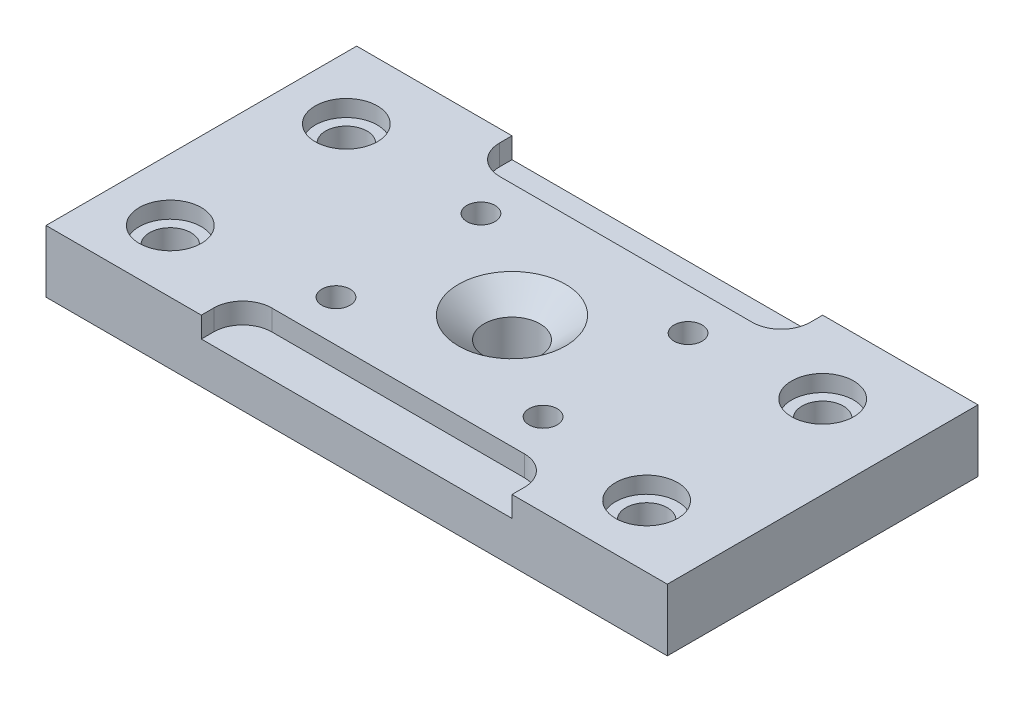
ISO-10303-21;
HEADER;
FILE_DESCRIPTION(('STEP AP214'),'2;1');
FILE_NAME('part.step','',(''),(''),'','','');
FILE_SCHEMA(('AUTOMOTIVE_DESIGN { 1 0 10303 214 1 1 1 1 }'));
ENDSEC;
DATA;
#1=APPLICATION_CONTEXT('core data for automotive mechanical design processes');
#2=APPLICATION_PROTOCOL_DEFINITION('international standard','automotive_design',2000,#1);
#3=PRODUCT_CONTEXT('',#1,'mechanical');
#4=PRODUCT('Part','Part','',(#3));
#5=PRODUCT_RELATED_PRODUCT_CATEGORY('part','',(#4));
#6=PRODUCT_DEFINITION_FORMATION('','',#4);
#7=PRODUCT_DEFINITION_CONTEXT('part definition',#1,'design');
#8=PRODUCT_DEFINITION('design','',#6,#7);
#9=PRODUCT_DEFINITION_SHAPE('','',#8);
#10=(LENGTH_UNIT() NAMED_UNIT(*) SI_UNIT(.MILLI.,.METRE.));
#11=(NAMED_UNIT(*) PLANE_ANGLE_UNIT() SI_UNIT($,.RADIAN.));
#12=(NAMED_UNIT(*) SI_UNIT($,.STERADIAN.) SOLID_ANGLE_UNIT());
#13=UNCERTAINTY_MEASURE_WITH_UNIT(LENGTH_MEASURE(1.E-05),#10,'distance_accuracy_value','');
#14=(GEOMETRIC_REPRESENTATION_CONTEXT(3) GLOBAL_UNCERTAINTY_ASSIGNED_CONTEXT((#13)) GLOBAL_UNIT_ASSIGNED_CONTEXT((#10,
#11,#12)) REPRESENTATION_CONTEXT('',''));
#15=CARTESIAN_POINT('',(0.,0.,0.));
#16=DIRECTION('',(0.,0.,1.));
#17=DIRECTION('',(1.,0.,0.));
#18=AXIS2_PLACEMENT_3D('',#15,#16,#17);
#19=CARTESIAN_POINT('',(-75.,15.,-37.5));
#20=DIRECTION('',(1.,0.,0.));
#21=DIRECTION('',(0.,0.,-1.));
#22=AXIS2_PLACEMENT_3D('',#19,#20,#21);
#23=PLANE('',#22);
#24=DIRECTION('',(0.,0.,1.));
#25=VECTOR('',#24,1.);
#26=CARTESIAN_POINT('',(-75.,0.,-37.5));
#27=LINE('',#26,#25);
#28=CARTESIAN_POINT('',(-75.,0.,-37.5));
#29=VERTEX_POINT('',#28);
#30=CARTESIAN_POINT('',(-75.,0.,37.5));
#31=VERTEX_POINT('',#30);
#32=EDGE_CURVE('E232',#29,#31,#27,.T.);
#33=ORIENTED_EDGE('',*,*,#32,.T.);
#34=DIRECTION('',(0.,-1.,0.));
#35=VECTOR('',#34,1.);
#36=CARTESIAN_POINT('',(-75.,15.,37.5));
#37=LINE('',#36,#35);
#38=CARTESIAN_POINT('',(-75.,15.,37.5));
#39=VERTEX_POINT('',#38);
#40=EDGE_CURVE('E271',#39,#31,#37,.T.);
#41=ORIENTED_EDGE('',*,*,#40,.F.);
#42=DIRECTION('',(0.,0.,1.));
#43=VECTOR('',#42,1.);
#44=CARTESIAN_POINT('',(-75.,15.,-37.5));
#45=LINE('',#44,#43);
#46=CARTESIAN_POINT('',(-75.,15.,-37.5));
#47=VERTEX_POINT('',#46);
#48=EDGE_CURVE('E250',#47,#39,#45,.T.);
#49=ORIENTED_EDGE('',*,*,#48,.F.);
#50=DIRECTION('',(0.,-1.,0.));
#51=VECTOR('',#50,1.);
#52=CARTESIAN_POINT('',(-75.,15.,-37.5));
#53=LINE('',#52,#51);
#54=EDGE_CURVE('E262',#47,#29,#53,.T.);
#55=ORIENTED_EDGE('',*,*,#54,.T.);
#56=EDGE_LOOP('',(#33,#41,#49,#55));
#57=FACE_BOUND('',#56,.T.);
#58=ADVANCED_FACE('F30',(#57),#23,.F.);
#59=CARTESIAN_POINT('',(-75.,15.,37.5));
#60=DIRECTION('',(0.,0.,-1.));
#61=DIRECTION('',(-1.,0.,0.));
#62=AXIS2_PLACEMENT_3D('',#59,#60,#61);
#63=PLANE('',#62);
#64=DIRECTION('',(1.,0.,0.));
#65=VECTOR('',#64,1.);
#66=CARTESIAN_POINT('',(37.5,10.,37.5));
#67=LINE('',#66,#65);
#68=CARTESIAN_POINT('',(-37.5,10.,37.5));
#69=VERTEX_POINT('',#68);
#70=CARTESIAN_POINT('',(37.5,10.,37.5));
#71=VERTEX_POINT('',#70);
#72=EDGE_CURVE('E211',#69,#71,#67,.T.);
#73=ORIENTED_EDGE('',*,*,#72,.F.);
#74=DIRECTION('',(0.,1.,0.));
#75=VECTOR('',#74,1.);
#76=CARTESIAN_POINT('',(-37.5,10.,37.5));
#77=LINE('',#76,#75);
#78=CARTESIAN_POINT('',(-37.5,15.,37.5));
#79=VERTEX_POINT('',#78);
#80=EDGE_CURVE('E229',#69,#79,#77,.T.);
#81=ORIENTED_EDGE('',*,*,#80,.T.);
#82=DIRECTION('',(1.,0.,0.));
#83=VECTOR('',#82,1.);
#84=CARTESIAN_POINT('',(-75.,15.,37.5));
#85=LINE('',#84,#83);
#86=EDGE_CURVE('E254',#39,#79,#85,.T.);
#87=ORIENTED_EDGE('',*,*,#86,.F.);
#88=ORIENTED_EDGE('',*,*,#40,.T.);
#89=DIRECTION('',(1.,0.,0.));
#90=VECTOR('',#89,1.);
#91=CARTESIAN_POINT('',(-75.,0.,37.5));
#92=LINE('',#91,#90);
#93=CARTESIAN_POINT('',(75.,0.,37.5));
#94=VERTEX_POINT('',#93);
#95=EDGE_CURVE('E244',#31,#94,#92,.T.);
#96=ORIENTED_EDGE('',*,*,#95,.T.);
#97=DIRECTION('',(0.,-1.,0.));
#98=VECTOR('',#97,1.);
#99=CARTESIAN_POINT('',(75.,15.,37.5));
#100=LINE('',#99,#98);
#101=CARTESIAN_POINT('',(75.,15.,37.5));
#102=VERTEX_POINT('',#101);
#103=EDGE_CURVE('E268',#102,#94,#100,.T.);
#104=ORIENTED_EDGE('',*,*,#103,.F.);
#105=CARTESIAN_POINT('',(37.5,15.,37.5));
#106=VERTEX_POINT('',#105);
#107=EDGE_CURVE('E253',#106,#102,#85,.T.);
#108=ORIENTED_EDGE('',*,*,#107,.F.);
#109=DIRECTION('',(0.,1.,0.));
#110=VECTOR('',#109,1.);
#111=CARTESIAN_POINT('',(37.5,10.,37.5));
#112=LINE('',#111,#110);
#113=EDGE_CURVE('E53',#71,#106,#112,.T.);
#114=ORIENTED_EDGE('',*,*,#113,.F.);
#115=EDGE_LOOP('',(#73,#81,#87,#88,#96,#104,#108,#114));
#116=FACE_BOUND('',#115,.T.);
#117=ADVANCED_FACE('F335',(#116),#63,.F.);
#118=CARTESIAN_POINT('',(75.,15.,-37.5));
#119=DIRECTION('',(-1.,0.,0.));
#120=DIRECTION('',(0.,0.,1.));
#121=AXIS2_PLACEMENT_3D('',#118,#119,#120);
#122=PLANE('',#121);
#123=DIRECTION('',(0.,0.,-1.));
#124=VECTOR('',#123,1.);
#125=CARTESIAN_POINT('',(75.,0.,-37.5));
#126=LINE('',#125,#124);
#127=CARTESIAN_POINT('',(75.,0.,-37.5));
#128=VERTEX_POINT('',#127);
#129=EDGE_CURVE('E246',#94,#128,#126,.T.);
#130=ORIENTED_EDGE('',*,*,#129,.T.);
#131=DIRECTION('',(0.,-1.,0.));
#132=VECTOR('',#131,1.);
#133=CARTESIAN_POINT('',(75.,15.,-37.5));
#134=LINE('',#133,#132);
#135=CARTESIAN_POINT('',(75.,15.,-37.5));
#136=VERTEX_POINT('',#135);
#137=EDGE_CURVE('E265',#136,#128,#134,.T.);
#138=ORIENTED_EDGE('',*,*,#137,.F.);
#139=DIRECTION('',(0.,0.,-1.));
#140=VECTOR('',#139,1.);
#141=CARTESIAN_POINT('',(75.,15.,-37.5));
#142=LINE('',#141,#140);
#143=EDGE_CURVE('E257',#102,#136,#142,.T.);
#144=ORIENTED_EDGE('',*,*,#143,.F.);
#145=ORIENTED_EDGE('',*,*,#103,.T.);
#146=EDGE_LOOP('',(#130,#138,#144,#145));
#147=FACE_BOUND('',#146,.T.);
#148=ADVANCED_FACE('F329',(#147),#122,.F.);
#149=CARTESIAN_POINT('',(-75.,15.,-37.5));
#150=DIRECTION('',(0.,0.,1.));
#151=DIRECTION('',(1.,0.,0.));
#152=AXIS2_PLACEMENT_3D('',#149,#150,#151);
#153=PLANE('',#152);
#154=DIRECTION('',(-1.,0.,0.));
#155=VECTOR('',#154,1.);
#156=CARTESIAN_POINT('',(-75.,15.,-37.5));
#157=LINE('',#156,#155);
#158=CARTESIAN_POINT('',(-37.5,15.,-37.5));
#159=VERTEX_POINT('',#158);
#160=EDGE_CURVE('E259',#159,#47,#157,.T.);
#161=ORIENTED_EDGE('',*,*,#160,.F.);
#162=DIRECTION('',(0.,1.,0.));
#163=VECTOR('',#162,1.);
#164=CARTESIAN_POINT('',(-37.5,10.,-37.5));
#165=LINE('',#164,#163);
#166=CARTESIAN_POINT('',(-37.5,10.,-37.5));
#167=VERTEX_POINT('',#166);
#168=EDGE_CURVE('E192',#167,#159,#165,.T.);
#169=ORIENTED_EDGE('',*,*,#168,.F.);
#170=DIRECTION('',(-1.,0.,0.));
#171=VECTOR('',#170,1.);
#172=CARTESIAN_POINT('',(37.5,10.,-37.5));
#173=LINE('',#172,#171);
#174=CARTESIAN_POINT('',(37.5,10.,-37.5));
#175=VERTEX_POINT('',#174);
#176=EDGE_CURVE('E184',#175,#167,#173,.T.);
#177=ORIENTED_EDGE('',*,*,#176,.F.);
#178=DIRECTION('',(0.,1.,0.));
#179=VECTOR('',#178,1.);
#180=CARTESIAN_POINT('',(37.5,10.,-37.5));
#181=LINE('',#180,#179);
#182=CARTESIAN_POINT('',(37.5,15.,-37.5));
#183=VERTEX_POINT('',#182);
#184=EDGE_CURVE('E194',#175,#183,#181,.T.);
#185=ORIENTED_EDGE('',*,*,#184,.T.);
#186=EDGE_CURVE('E260',#136,#183,#157,.T.);
#187=ORIENTED_EDGE('',*,*,#186,.F.);
#188=ORIENTED_EDGE('',*,*,#137,.T.);
#189=DIRECTION('',(-1.,0.,0.));
#190=VECTOR('',#189,1.);
#191=CARTESIAN_POINT('',(-75.,0.,-37.5));
#192=LINE('',#191,#190);
#193=EDGE_CURVE('E248',#128,#29,#192,.T.);
#194=ORIENTED_EDGE('',*,*,#193,.T.);
#195=ORIENTED_EDGE('',*,*,#54,.F.);
#196=EDGE_LOOP('',(#161,#169,#177,#185,#187,#188,#194,#195));
#197=FACE_BOUND('',#196,.T.);
#198=ADVANCED_FACE('F318',(#197),#153,.F.);
#199=CARTESIAN_POINT('',(-75.,15.,37.5));
#200=DIRECTION('',(0.,1.,0.));
#201=DIRECTION('',(0.,0.,1.));
#202=AXIS2_PLACEMENT_3D('',#199,#200,#201);
#203=PLANE('',#202);
#204=CARTESIAN_POINT('',(25.,15.,17.5));
#205=DIRECTION('',(0.,1.,0.));
#206=DIRECTION('',(0.,0.,1.));
#207=AXIS2_PLACEMENT_3D('',#204,#205,#206);
#208=CIRCLE('',#207,3.39999999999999);
#209=CARTESIAN_POINT('',(25.,15.,20.9));
#210=VERTEX_POINT('',#209);
#211=EDGE_CURVE('E512',#210,#210,#208,.T.);
#212=ORIENTED_EDGE('',*,*,#211,.F.);
#213=EDGE_LOOP('',(#212));
#214=FACE_BOUND('',#213,.T.);
#215=CARTESIAN_POINT('',(-25.,15.,17.5));
#216=DIRECTION('',(0.,1.,0.));
#217=DIRECTION('',(0.,0.,1.));
#218=AXIS2_PLACEMENT_3D('',#215,#216,#217);
#219=CIRCLE('',#218,3.39999999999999);
#220=CARTESIAN_POINT('',(-25.,15.,20.9));
#221=VERTEX_POINT('',#220);
#222=EDGE_CURVE('E506',#221,#221,#219,.T.);
#223=ORIENTED_EDGE('',*,*,#222,.F.);
#224=EDGE_LOOP('',(#223));
#225=FACE_BOUND('',#224,.T.);
#226=CARTESIAN_POINT('',(-25.,15.,-17.5));
#227=DIRECTION('',(0.,1.,0.));
#228=DIRECTION('',(0.,0.,1.));
#229=AXIS2_PLACEMENT_3D('',#226,#227,#228);
#230=CIRCLE('',#229,3.39999999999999);
#231=CARTESIAN_POINT('',(-25.,15.,-14.1));
#232=VERTEX_POINT('',#231);
#233=EDGE_CURVE('E500',#232,#232,#230,.T.);
#234=ORIENTED_EDGE('',*,*,#233,.F.);
#235=EDGE_LOOP('',(#234));
#236=FACE_BOUND('',#235,.T.);
#237=CARTESIAN_POINT('',(25.,15.,-17.5));
#238=DIRECTION('',(0.,1.,0.));
#239=DIRECTION('',(0.,0.,1.));
#240=AXIS2_PLACEMENT_3D('',#237,#238,#239);
#241=CIRCLE('',#240,3.39999999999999);
#242=CARTESIAN_POINT('',(25.,15.,-14.1));
#243=VERTEX_POINT('',#242);
#244=EDGE_CURVE('E494',#243,#243,#241,.T.);
#245=ORIENTED_EDGE('',*,*,#244,.F.);
#246=EDGE_LOOP('',(#245));
#247=FACE_BOUND('',#246,.T.);
#248=CARTESIAN_POINT('',(-60.,15.,-20.));
#249=DIRECTION('',(0.,1.,0.));
#250=DIRECTION('',(0.,0.,1.));
#251=AXIS2_PLACEMENT_3D('',#248,#249,#250);
#252=CIRCLE('',#251,7.5);
#253=CARTESIAN_POINT('',(-60.,15.,-12.5));
#254=VERTEX_POINT('',#253);
#255=EDGE_CURVE('E491',#254,#254,#252,.T.);
#256=ORIENTED_EDGE('',*,*,#255,.F.);
#257=EDGE_LOOP('',(#256));
#258=FACE_BOUND('',#257,.T.);
#259=CARTESIAN_POINT('',(-60.,15.,22.5));
#260=DIRECTION('',(0.,1.,0.));
#261=DIRECTION('',(0.,0.,1.));
#262=AXIS2_PLACEMENT_3D('',#259,#260,#261);
#263=CIRCLE('',#262,7.5);
#264=CARTESIAN_POINT('',(-60.,15.,30.));
#265=VERTEX_POINT('',#264);
#266=EDGE_CURVE('E283',#265,#265,#263,.T.);
#267=ORIENTED_EDGE('',*,*,#266,.F.);
#268=EDGE_LOOP('',(#267));
#269=FACE_BOUND('',#268,.T.);
#270=CARTESIAN_POINT('',(0.,15.,0.));
#271=DIRECTION('',(0.,1.,0.));
#272=DIRECTION('',(0.,0.,1.));
#273=AXIS2_PLACEMENT_3D('',#270,#271,#272);
#274=CIRCLE('',#273,12.9159);
#275=CARTESIAN_POINT('',(0.,15.,12.9159));
#276=VERTEX_POINT('',#275);
#277=EDGE_CURVE('E278',#276,#276,#274,.T.);
#278=ORIENTED_EDGE('',*,*,#277,.F.);
#279=EDGE_LOOP('',(#278));
#280=FACE_BOUND('',#279,.T.);
#281=DIRECTION('',(0.,0.,1.));
#282=VECTOR('',#281,1.);
#283=CARTESIAN_POINT('',(-37.5,15.,-37.5));
#284=LINE('',#283,#282);
#285=CARTESIAN_POINT('',(-37.5,15.,-34.5));
#286=VERTEX_POINT('',#285);
#287=EDGE_CURVE('E169',#159,#286,#284,.T.);
#288=ORIENTED_EDGE('',*,*,#287,.F.);
#289=ORIENTED_EDGE('',*,*,#160,.T.);
#290=ORIENTED_EDGE('',*,*,#48,.T.);
#291=ORIENTED_EDGE('',*,*,#86,.T.);
#292=DIRECTION('',(0.,0.,1.));
#293=VECTOR('',#292,1.);
#294=CARTESIAN_POINT('',(-37.5,15.,37.5));
#295=LINE('',#294,#293);
#296=CARTESIAN_POINT('',(-37.5,15.,34.5));
#297=VERTEX_POINT('',#296);
#298=EDGE_CURVE('E209',#297,#79,#295,.T.);
#299=ORIENTED_EDGE('',*,*,#298,.F.);
#300=CARTESIAN_POINT('',(-30.5,15.,34.5));
#301=DIRECTION('',(0.,1.,0.));
#302=DIRECTION('',(0.,0.,1.));
#303=AXIS2_PLACEMENT_3D('',#300,#301,#302);
#304=CIRCLE('',#303,7.);
#305=CARTESIAN_POINT('',(-30.5,15.,27.5));
#306=VERTEX_POINT('',#305);
#307=EDGE_CURVE('E206',#306,#297,#304,.T.);
#308=ORIENTED_EDGE('',*,*,#307,.F.);
#309=DIRECTION('',(-1.,0.,0.));
#310=VECTOR('',#309,1.);
#311=CARTESIAN_POINT('',(30.5,15.,27.5));
#312=LINE('',#311,#310);
#313=CARTESIAN_POINT('',(30.5,15.,27.5));
#314=VERTEX_POINT('',#313);
#315=EDGE_CURVE('E203',#314,#306,#312,.T.);
#316=ORIENTED_EDGE('',*,*,#315,.F.);
#317=CARTESIAN_POINT('',(30.5,15.,34.5));
#318=DIRECTION('',(0.,1.,0.));
#319=DIRECTION('',(0.,0.,-1.));
#320=AXIS2_PLACEMENT_3D('',#317,#318,#319);
#321=CIRCLE('',#320,7.);
#322=CARTESIAN_POINT('',(37.5,15.,34.5));
#323=VERTEX_POINT('',#322);
#324=EDGE_CURVE('E200',#323,#314,#321,.T.);
#325=ORIENTED_EDGE('',*,*,#324,.F.);
#326=DIRECTION('',(0.,0.,-1.));
#327=VECTOR('',#326,1.);
#328=CARTESIAN_POINT('',(37.5,15.,37.5));
#329=LINE('',#328,#327);
#330=EDGE_CURVE('E191',#106,#323,#329,.T.);
#331=ORIENTED_EDGE('',*,*,#330,.F.);
#332=ORIENTED_EDGE('',*,*,#107,.T.);
#333=ORIENTED_EDGE('',*,*,#143,.T.);
#334=ORIENTED_EDGE('',*,*,#186,.T.);
#335=DIRECTION('',(0.,0.,-1.));
#336=VECTOR('',#335,1.);
#337=CARTESIAN_POINT('',(37.5,15.,-37.5));
#338=LINE('',#337,#336);
#339=CARTESIAN_POINT('',(37.5,15.,-34.5));
#340=VERTEX_POINT('',#339);
#341=EDGE_CURVE('E167',#340,#183,#338,.T.);
#342=ORIENTED_EDGE('',*,*,#341,.F.);
#343=CARTESIAN_POINT('',(30.5,15.,-34.5));
#344=DIRECTION('',(0.,1.,0.));
#345=DIRECTION('',(0.,0.,1.));
#346=AXIS2_PLACEMENT_3D('',#343,#344,#345);
#347=CIRCLE('',#346,7.);
#348=CARTESIAN_POINT('',(30.5,15.,-27.5));
#349=VERTEX_POINT('',#348);
#350=EDGE_CURVE('E148',#349,#340,#347,.T.);
#351=ORIENTED_EDGE('',*,*,#350,.F.);
#352=DIRECTION('',(1.,0.,0.));
#353=VECTOR('',#352,1.);
#354=CARTESIAN_POINT('',(30.5,15.,-27.5));
#355=LINE('',#354,#353);
#356=CARTESIAN_POINT('',(-30.5,15.,-27.5));
#357=VERTEX_POINT('',#356);
#358=EDGE_CURVE('E159',#357,#349,#355,.T.);
#359=ORIENTED_EDGE('',*,*,#358,.F.);
#360=CARTESIAN_POINT('',(-30.5,15.,-34.5));
#361=DIRECTION('',(0.,1.,0.));
#362=DIRECTION('',(0.,0.,-1.));
#363=AXIS2_PLACEMENT_3D('',#360,#361,#362);
#364=CIRCLE('',#363,7.);
#365=EDGE_CURVE('E45',#286,#357,#364,.T.);
#366=ORIENTED_EDGE('',*,*,#365,.F.);
#367=EDGE_LOOP('',(#288,#289,#290,#291,#299,#308,#316,#325,#331,#332,#333,#334,#342,#351,#359,#366));
#368=FACE_BOUND('',#367,.T.);
#369=CARTESIAN_POINT('',(55.,15.,22.5));
#370=DIRECTION('',(0.,1.,0.));
#371=DIRECTION('',(0.,0.,1.));
#372=AXIS2_PLACEMENT_3D('',#369,#370,#371);
#373=CIRCLE('',#372,7.5);
#374=CARTESIAN_POINT('',(55.,15.,30.));
#375=VERTEX_POINT('',#374);
#376=EDGE_CURVE('E274',#375,#375,#373,.T.);
#377=ORIENTED_EDGE('',*,*,#376,.F.);
#378=EDGE_LOOP('',(#377));
#379=FACE_BOUND('',#378,.T.);
#380=CARTESIAN_POINT('',(55.,15.,-20.));
#381=DIRECTION('',(0.,1.,0.));
#382=DIRECTION('',(0.,0.,1.));
#383=AXIS2_PLACEMENT_3D('',#380,#381,#382);
#384=CIRCLE('',#383,7.5);
#385=CARTESIAN_POINT('',(55.,15.,-12.5));
#386=VERTEX_POINT('',#385);
#387=EDGE_CURVE('E295',#386,#386,#384,.T.);
#388=ORIENTED_EDGE('',*,*,#387,.F.);
#389=EDGE_LOOP('',(#388));
#390=FACE_BOUND('',#389,.T.);
#391=ADVANCED_FACE('F164',(#214,#225,#236,#247,#258,#269,#280,#368,#379,#390),#203,.T.);
#392=CARTESIAN_POINT('',(-75.,0.,37.5));
#393=DIRECTION('',(0.,1.,0.));
#394=DIRECTION('',(0.,0.,1.));
#395=AXIS2_PLACEMENT_3D('',#392,#393,#394);
#396=PLANE('',#395);
#397=CARTESIAN_POINT('',(25.,0.,17.5));
#398=DIRECTION('',(0.,1.,0.));
#399=DIRECTION('',(0.,0.,1.));
#400=AXIS2_PLACEMENT_3D('',#397,#398,#399);
#401=CIRCLE('',#400,3.4);
#402=CARTESIAN_POINT('',(25.,0.,20.9));
#403=VERTEX_POINT('',#402);
#404=EDGE_CURVE('E515',#403,#403,#401,.T.);
#405=ORIENTED_EDGE('',*,*,#404,.T.);
#406=EDGE_LOOP('',(#405));
#407=FACE_BOUND('',#406,.T.);
#408=CARTESIAN_POINT('',(-25.,0.,17.5));
#409=DIRECTION('',(0.,1.,0.));
#410=DIRECTION('',(0.,0.,1.));
#411=AXIS2_PLACEMENT_3D('',#408,#409,#410);
#412=CIRCLE('',#411,3.4);
#413=CARTESIAN_POINT('',(-25.,0.,20.9));
#414=VERTEX_POINT('',#413);
#415=EDGE_CURVE('E509',#414,#414,#412,.T.);
#416=ORIENTED_EDGE('',*,*,#415,.T.);
#417=EDGE_LOOP('',(#416));
#418=FACE_BOUND('',#417,.T.);
#419=CARTESIAN_POINT('',(-25.,0.,-17.5));
#420=DIRECTION('',(0.,1.,0.));
#421=DIRECTION('',(0.,0.,1.));
#422=AXIS2_PLACEMENT_3D('',#419,#420,#421);
#423=CIRCLE('',#422,3.4);
#424=CARTESIAN_POINT('',(-25.,0.,-14.1));
#425=VERTEX_POINT('',#424);
#426=EDGE_CURVE('E503',#425,#425,#423,.T.);
#427=ORIENTED_EDGE('',*,*,#426,.T.);
#428=EDGE_LOOP('',(#427));
#429=FACE_BOUND('',#428,.T.);
#430=CARTESIAN_POINT('',(25.,0.,-17.5));
#431=DIRECTION('',(0.,1.,0.));
#432=DIRECTION('',(0.,0.,1.));
#433=AXIS2_PLACEMENT_3D('',#430,#431,#432);
#434=CIRCLE('',#433,3.4);
#435=CARTESIAN_POINT('',(25.,0.,-14.1));
#436=VERTEX_POINT('',#435);
#437=EDGE_CURVE('E497',#436,#436,#434,.T.);
#438=ORIENTED_EDGE('',*,*,#437,.T.);
#439=EDGE_LOOP('',(#438));
#440=FACE_BOUND('',#439,.T.);
#441=CARTESIAN_POINT('',(-60.,0.,-20.));
#442=DIRECTION('',(0.,1.,0.));
#443=DIRECTION('',(0.,0.,1.));
#444=AXIS2_PLACEMENT_3D('',#441,#442,#443);
#445=CIRCLE('',#444,4.99999999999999);
#446=CARTESIAN_POINT('',(-60.,0.,-15.));
#447=VERTEX_POINT('',#446);
#448=EDGE_CURVE('E488',#447,#447,#445,.T.);
#449=ORIENTED_EDGE('',*,*,#448,.T.);
#450=EDGE_LOOP('',(#449));
#451=FACE_BOUND('',#450,.T.);
#452=CARTESIAN_POINT('',(-60.,0.,22.5));
#453=DIRECTION('',(0.,1.,0.));
#454=DIRECTION('',(0.,0.,1.));
#455=AXIS2_PLACEMENT_3D('',#452,#453,#454);
#456=CIRCLE('',#455,4.99999999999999);
#457=CARTESIAN_POINT('',(-60.,0.,27.5));
#458=VERTEX_POINT('',#457);
#459=EDGE_CURVE('E279',#458,#458,#456,.T.);
#460=ORIENTED_EDGE('',*,*,#459,.T.);
#461=EDGE_LOOP('',(#460));
#462=FACE_BOUND('',#461,.T.);
#463=CARTESIAN_POINT('',(0.,0.,0.));
#464=DIRECTION('',(0.,1.,0.));
#465=DIRECTION('',(0.,0.,1.));
#466=AXIS2_PLACEMENT_3D('',#463,#464,#465);
#467=CIRCLE('',#466,6.74624);
#468=CARTESIAN_POINT('',(0.,0.,6.74624));
#469=VERTEX_POINT('',#468);
#470=EDGE_CURVE('E275',#469,#469,#467,.T.);
#471=ORIENTED_EDGE('',*,*,#470,.T.);
#472=EDGE_LOOP('',(#471));
#473=FACE_BOUND('',#472,.T.);
#474=ORIENTED_EDGE('',*,*,#32,.F.);
#475=ORIENTED_EDGE('',*,*,#193,.F.);
#476=ORIENTED_EDGE('',*,*,#129,.F.);
#477=ORIENTED_EDGE('',*,*,#95,.F.);
#478=EDGE_LOOP('',(#474,#475,#476,#477));
#479=FACE_BOUND('',#478,.T.);
#480=CARTESIAN_POINT('',(55.,0.,22.5));
#481=DIRECTION('',(0.,1.,0.));
#482=DIRECTION('',(0.,0.,1.));
#483=AXIS2_PLACEMENT_3D('',#480,#481,#482);
#484=CIRCLE('',#483,4.99999999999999);
#485=CARTESIAN_POINT('',(55.,0.,27.5));
#486=VERTEX_POINT('',#485);
#487=EDGE_CURVE('E286',#486,#486,#484,.T.);
#488=ORIENTED_EDGE('',*,*,#487,.T.);
#489=EDGE_LOOP('',(#488));
#490=FACE_BOUND('',#489,.T.);
#491=CARTESIAN_POINT('',(55.,0.,-20.));
#492=DIRECTION('',(0.,1.,0.));
#493=DIRECTION('',(0.,0.,1.));
#494=AXIS2_PLACEMENT_3D('',#491,#492,#493);
#495=CIRCLE('',#494,4.99999999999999);
#496=CARTESIAN_POINT('',(55.,0.,-15.));
#497=VERTEX_POINT('',#496);
#498=EDGE_CURVE('E298',#497,#497,#495,.T.);
#499=ORIENTED_EDGE('',*,*,#498,.T.);
#500=EDGE_LOOP('',(#499));
#501=FACE_BOUND('',#500,.T.);
#502=ADVANCED_FACE('F317',(#407,#418,#429,#440,#451,#462,#473,#479,#490,#501),#396,.F.);
#503=CARTESIAN_POINT('',(-37.5,10.,37.5));
#504=DIRECTION('',(-1.,0.,0.));
#505=DIRECTION('',(0.,0.,1.));
#506=AXIS2_PLACEMENT_3D('',#503,#504,#505);
#507=PLANE('',#506);
#508=ORIENTED_EDGE('',*,*,#298,.T.);
#509=ORIENTED_EDGE('',*,*,#80,.F.);
#510=DIRECTION('',(0.,0.,1.));
#511=VECTOR('',#510,1.);
#512=CARTESIAN_POINT('',(-37.5,10.,37.5));
#513=LINE('',#512,#511);
#514=CARTESIAN_POINT('',(-37.5,10.,34.5));
#515=VERTEX_POINT('',#514);
#516=EDGE_CURVE('E226',#515,#69,#513,.T.);
#517=ORIENTED_EDGE('',*,*,#516,.F.);
#518=DIRECTION('',(0.,1.,0.));
#519=VECTOR('',#518,1.);
#520=CARTESIAN_POINT('',(-37.5,10.,34.5));
#521=LINE('',#520,#519);
#522=EDGE_CURVE('E233',#515,#297,#521,.T.);
#523=ORIENTED_EDGE('',*,*,#522,.T.);
#524=EDGE_LOOP('',(#508,#509,#517,#523));
#525=FACE_BOUND('',#524,.T.);
#526=ADVANCED_FACE('F325',(#525),#507,.F.);
#527=CARTESIAN_POINT('',(-30.5,10.,34.5));
#528=DIRECTION('',(0.,1.,0.));
#529=DIRECTION('',(0.,0.,1.));
#530=AXIS2_PLACEMENT_3D('',#527,#528,#529);
#531=CYLINDRICAL_SURFACE('',#530,7.);
#532=ORIENTED_EDGE('',*,*,#307,.T.);
#533=ORIENTED_EDGE('',*,*,#522,.F.);
#534=CARTESIAN_POINT('',(-30.5,10.,34.5));
#535=DIRECTION('',(0.,1.,0.));
#536=DIRECTION('',(0.,0.,1.));
#537=AXIS2_PLACEMENT_3D('',#534,#535,#536);
#538=CIRCLE('',#537,7.);
#539=CARTESIAN_POINT('',(-30.5,10.,27.5));
#540=VERTEX_POINT('',#539);
#541=EDGE_CURVE('E223',#540,#515,#538,.T.);
#542=ORIENTED_EDGE('',*,*,#541,.F.);
#543=DIRECTION('',(0.,1.,0.));
#544=VECTOR('',#543,1.);
#545=CARTESIAN_POINT('',(-30.5,10.,27.5));
#546=LINE('',#545,#544);
#547=EDGE_CURVE('E235',#540,#306,#546,.T.);
#548=ORIENTED_EDGE('',*,*,#547,.T.);
#549=EDGE_LOOP('',(#532,#533,#542,#548));
#550=FACE_BOUND('',#549,.T.);
#551=ADVANCED_FACE('F432',(#550),#531,.F.);
#552=CARTESIAN_POINT('',(30.5,10.,27.5));
#553=DIRECTION('',(0.,0.,-1.));
#554=DIRECTION('',(-1.,0.,0.));
#555=AXIS2_PLACEMENT_3D('',#552,#553,#554);
#556=PLANE('',#555);
#557=ORIENTED_EDGE('',*,*,#315,.T.);
#558=ORIENTED_EDGE('',*,*,#547,.F.);
#559=DIRECTION('',(-1.,0.,0.));
#560=VECTOR('',#559,1.);
#561=CARTESIAN_POINT('',(30.5,10.,27.5));
#562=LINE('',#561,#560);
#563=CARTESIAN_POINT('',(30.5,10.,27.5));
#564=VERTEX_POINT('',#563);
#565=EDGE_CURVE('E220',#564,#540,#562,.T.);
#566=ORIENTED_EDGE('',*,*,#565,.F.);
#567=DIRECTION('',(0.,1.,0.));
#568=VECTOR('',#567,1.);
#569=CARTESIAN_POINT('',(30.5,10.,27.5));
#570=LINE('',#569,#568);
#571=EDGE_CURVE('E237',#564,#314,#570,.T.);
#572=ORIENTED_EDGE('',*,*,#571,.T.);
#573=EDGE_LOOP('',(#557,#558,#566,#572));
#574=FACE_BOUND('',#573,.T.);
#575=ADVANCED_FACE('F436',(#574),#556,.F.);
#576=CARTESIAN_POINT('',(30.5,10.,34.5));
#577=DIRECTION('',(0.,1.,0.));
#578=DIRECTION('',(0.,0.,1.));
#579=AXIS2_PLACEMENT_3D('',#576,#577,#578);
#580=CYLINDRICAL_SURFACE('',#579,7.);
#581=ORIENTED_EDGE('',*,*,#324,.T.);
#582=ORIENTED_EDGE('',*,*,#571,.F.);
#583=CARTESIAN_POINT('',(30.5,10.,34.5));
#584=DIRECTION('',(0.,1.,0.));
#585=DIRECTION('',(0.,0.,-1.));
#586=AXIS2_PLACEMENT_3D('',#583,#584,#585);
#587=CIRCLE('',#586,7.);
#588=CARTESIAN_POINT('',(37.5,10.,34.5));
#589=VERTEX_POINT('',#588);
#590=EDGE_CURVE('E217',#589,#564,#587,.T.);
#591=ORIENTED_EDGE('',*,*,#590,.F.);
#592=DIRECTION('',(0.,1.,0.));
#593=VECTOR('',#592,1.);
#594=CARTESIAN_POINT('',(37.5,10.,34.5));
#595=LINE('',#594,#593);
#596=EDGE_CURVE('E239',#589,#323,#595,.T.);
#597=ORIENTED_EDGE('',*,*,#596,.T.);
#598=EDGE_LOOP('',(#581,#582,#591,#597));
#599=FACE_BOUND('',#598,.T.);
#600=ADVANCED_FACE('F440',(#599),#580,.F.);
#601=CARTESIAN_POINT('',(37.5,10.,37.5));
#602=DIRECTION('',(1.,0.,0.));
#603=DIRECTION('',(0.,0.,-1.));
#604=AXIS2_PLACEMENT_3D('',#601,#602,#603);
#605=PLANE('',#604);
#606=ORIENTED_EDGE('',*,*,#330,.T.);
#607=ORIENTED_EDGE('',*,*,#596,.F.);
#608=DIRECTION('',(0.,0.,-1.));
#609=VECTOR('',#608,1.);
#610=CARTESIAN_POINT('',(37.5,10.,37.5));
#611=LINE('',#610,#609);
#612=EDGE_CURVE('E214',#71,#589,#611,.T.);
#613=ORIENTED_EDGE('',*,*,#612,.F.);
#614=ORIENTED_EDGE('',*,*,#113,.T.);
#615=EDGE_LOOP('',(#606,#607,#613,#614));
#616=FACE_BOUND('',#615,.T.);
#617=ADVANCED_FACE('F428',(#616),#605,.F.);
#618=CARTESIAN_POINT('',(-30.5,10.,34.5));
#619=DIRECTION('',(0.,1.,0.));
#620=DIRECTION('',(0.,0.,1.));
#621=AXIS2_PLACEMENT_3D('',#618,#619,#620);
#622=PLANE('',#621);
#623=ORIENTED_EDGE('',*,*,#72,.T.);
#624=ORIENTED_EDGE('',*,*,#612,.T.);
#625=ORIENTED_EDGE('',*,*,#590,.T.);
#626=ORIENTED_EDGE('',*,*,#565,.T.);
#627=ORIENTED_EDGE('',*,*,#541,.T.);
#628=ORIENTED_EDGE('',*,*,#516,.T.);
#629=EDGE_LOOP('',(#623,#624,#625,#626,#627,#628));
#630=FACE_BOUND('',#629,.T.);
#631=ADVANCED_FACE('F425',(#630),#622,.T.);
#632=CARTESIAN_POINT('',(-30.5,10.,-34.5));
#633=DIRECTION('',(0.,1.,0.));
#634=DIRECTION('',(0.,0.,1.));
#635=AXIS2_PLACEMENT_3D('',#632,#633,#634);
#636=CYLINDRICAL_SURFACE('',#635,7.);
#637=ORIENTED_EDGE('',*,*,#365,.T.);
#638=DIRECTION('',(0.,1.,0.));
#639=VECTOR('',#638,1.);
#640=CARTESIAN_POINT('',(-30.5,10.,-27.5));
#641=LINE('',#640,#639);
#642=CARTESIAN_POINT('',(-30.5,10.,-27.5));
#643=VERTEX_POINT('',#642);
#644=EDGE_CURVE('E156',#643,#357,#641,.T.);
#645=ORIENTED_EDGE('',*,*,#644,.F.);
#646=CARTESIAN_POINT('',(-30.5,10.,-34.5));
#647=DIRECTION('',(0.,1.,0.));
#648=DIRECTION('',(0.,0.,-1.));
#649=AXIS2_PLACEMENT_3D('',#646,#647,#648);
#650=CIRCLE('',#649,7.);
#651=CARTESIAN_POINT('',(-37.5,10.,-34.5));
#652=VERTEX_POINT('',#651);
#653=EDGE_CURVE('E175',#652,#643,#650,.T.);
#654=ORIENTED_EDGE('',*,*,#653,.F.);
#655=DIRECTION('',(0.,1.,0.));
#656=VECTOR('',#655,1.);
#657=CARTESIAN_POINT('',(-37.5,10.,-34.5));
#658=LINE('',#657,#656);
#659=EDGE_CURVE('E189',#652,#286,#658,.T.);
#660=ORIENTED_EDGE('',*,*,#659,.T.);
#661=EDGE_LOOP('',(#637,#645,#654,#660));
#662=FACE_BOUND('',#661,.T.);
#663=ADVANCED_FACE('F414',(#662),#636,.F.);
#664=CARTESIAN_POINT('',(-37.5,10.,-37.5));
#665=DIRECTION('',(-1.,0.,0.));
#666=DIRECTION('',(0.,0.,1.));
#667=AXIS2_PLACEMENT_3D('',#664,#665,#666);
#668=PLANE('',#667);
#669=ORIENTED_EDGE('',*,*,#287,.T.);
#670=ORIENTED_EDGE('',*,*,#659,.F.);
#671=DIRECTION('',(0.,0.,1.));
#672=VECTOR('',#671,1.);
#673=CARTESIAN_POINT('',(-37.5,10.,-37.5));
#674=LINE('',#673,#672);
#675=EDGE_CURVE('E186',#167,#652,#674,.T.);
#676=ORIENTED_EDGE('',*,*,#675,.F.);
#677=ORIENTED_EDGE('',*,*,#168,.T.);
#678=EDGE_LOOP('',(#669,#670,#676,#677));
#679=FACE_BOUND('',#678,.T.);
#680=ADVANCED_FACE('F410',(#679),#668,.F.);
#681=CARTESIAN_POINT('',(37.5,10.,-37.5));
#682=DIRECTION('',(1.,0.,0.));
#683=DIRECTION('',(0.,0.,-1.));
#684=AXIS2_PLACEMENT_3D('',#681,#682,#683);
#685=PLANE('',#684);
#686=ORIENTED_EDGE('',*,*,#341,.T.);
#687=ORIENTED_EDGE('',*,*,#184,.F.);
#688=DIRECTION('',(0.,0.,-1.));
#689=VECTOR('',#688,1.);
#690=CARTESIAN_POINT('',(37.5,10.,-37.5));
#691=LINE('',#690,#689);
#692=CARTESIAN_POINT('',(37.5,10.,-34.5));
#693=VERTEX_POINT('',#692);
#694=EDGE_CURVE('E181',#693,#175,#691,.T.);
#695=ORIENTED_EDGE('',*,*,#694,.F.);
#696=DIRECTION('',(0.,1.,0.));
#697=VECTOR('',#696,1.);
#698=CARTESIAN_POINT('',(37.5,10.,-34.5));
#699=LINE('',#698,#697);
#700=EDGE_CURVE('E155',#693,#340,#699,.T.);
#701=ORIENTED_EDGE('',*,*,#700,.T.);
#702=EDGE_LOOP('',(#686,#687,#695,#701));
#703=FACE_BOUND('',#702,.T.);
#704=ADVANCED_FACE('F413',(#703),#685,.F.);
#705=CARTESIAN_POINT('',(30.5,10.,-34.5));
#706=DIRECTION('',(0.,1.,0.));
#707=DIRECTION('',(0.,0.,1.));
#708=AXIS2_PLACEMENT_3D('',#705,#706,#707);
#709=CYLINDRICAL_SURFACE('',#708,7.);
#710=ORIENTED_EDGE('',*,*,#350,.T.);
#711=ORIENTED_EDGE('',*,*,#700,.F.);
#712=CARTESIAN_POINT('',(30.5,10.,-34.5));
#713=DIRECTION('',(0.,1.,0.));
#714=DIRECTION('',(0.,0.,1.));
#715=AXIS2_PLACEMENT_3D('',#712,#713,#714);
#716=CIRCLE('',#715,7.);
#717=CARTESIAN_POINT('',(30.5,10.,-27.5));
#718=VERTEX_POINT('',#717);
#719=EDGE_CURVE('E151',#718,#693,#716,.T.);
#720=ORIENTED_EDGE('',*,*,#719,.F.);
#721=DIRECTION('',(0.,1.,0.));
#722=VECTOR('',#721,1.);
#723=CARTESIAN_POINT('',(30.5,10.,-27.5));
#724=LINE('',#723,#722);
#725=EDGE_CURVE('E144',#718,#349,#724,.T.);
#726=ORIENTED_EDGE('',*,*,#725,.T.);
#727=EDGE_LOOP('',(#710,#711,#720,#726));
#728=FACE_BOUND('',#727,.T.);
#729=ADVANCED_FACE('F146',(#728),#709,.F.);
#730=CARTESIAN_POINT('',(30.5,10.,-27.5));
#731=DIRECTION('',(0.,0.,1.));
#732=DIRECTION('',(1.,0.,0.));
#733=AXIS2_PLACEMENT_3D('',#730,#731,#732);
#734=PLANE('',#733);
#735=ORIENTED_EDGE('',*,*,#358,.T.);
#736=ORIENTED_EDGE('',*,*,#725,.F.);
#737=DIRECTION('',(1.,0.,0.));
#738=VECTOR('',#737,1.);
#739=CARTESIAN_POINT('',(30.5,10.,-27.5));
#740=LINE('',#739,#738);
#741=EDGE_CURVE('E178',#643,#718,#740,.T.);
#742=ORIENTED_EDGE('',*,*,#741,.F.);
#743=ORIENTED_EDGE('',*,*,#644,.T.);
#744=EDGE_LOOP('',(#735,#736,#742,#743));
#745=FACE_BOUND('',#744,.T.);
#746=ADVANCED_FACE('F160',(#745),#734,.F.);
#747=CARTESIAN_POINT('',(-30.5,10.,-34.5));
#748=DIRECTION('',(0.,-1.,0.));
#749=DIRECTION('',(0.,0.,-1.));
#750=AXIS2_PLACEMENT_3D('',#747,#748,#749);
#751=PLANE('',#750);
#752=ORIENTED_EDGE('',*,*,#653,.T.);
#753=ORIENTED_EDGE('',*,*,#741,.T.);
#754=ORIENTED_EDGE('',*,*,#719,.T.);
#755=ORIENTED_EDGE('',*,*,#694,.T.);
#756=ORIENTED_EDGE('',*,*,#176,.T.);
#757=ORIENTED_EDGE('',*,*,#675,.T.);
#758=EDGE_LOOP('',(#752,#753,#754,#755,#756,#757));
#759=FACE_BOUND('',#758,.T.);
#760=ADVANCED_FACE('F402',(#759),#751,.F.);
#761=CARTESIAN_POINT('',(0.,15.,0.));
#762=DIRECTION('',(0.,1.,0.));
#763=DIRECTION('',(0.,0.,1.));
#764=AXIS2_PLACEMENT_3D('',#761,#762,#763);
#765=CYLINDRICAL_SURFACE('',#764,6.74624);
#766=CARTESIAN_POINT('',(0.,9.82304056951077,0.));
#767=DIRECTION('',(0.,1.,0.));
#768=DIRECTION('',(0.,0.,1.));
#769=AXIS2_PLACEMENT_3D('',#766,#767,#768);
#770=CIRCLE('',#769,6.74624);
#771=CARTESIAN_POINT('',(0.,9.82304056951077,6.74624));
#772=VERTEX_POINT('',#771);
#773=EDGE_CURVE('E282',#772,#772,#770,.T.);
#774=ORIENTED_EDGE('',*,*,#773,.T.);
#775=EDGE_LOOP('',(#774));
#776=FACE_BOUND('',#775,.T.);
#777=ORIENTED_EDGE('',*,*,#470,.F.);
#778=EDGE_LOOP('',(#777));
#779=FACE_BOUND('',#778,.T.);
#780=ADVANCED_FACE('F399',(#776,#779),#765,.F.);
#781=CARTESIAN_POINT('',(0.,15.,0.));
#782=DIRECTION('',(0.,1.,0.));
#783=DIRECTION('',(0.,0.,1.));
#784=AXIS2_PLACEMENT_3D('',#781,#782,#783);
#785=CONICAL_SURFACE('',#784,12.9159,0.872664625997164);
#786=ORIENTED_EDGE('',*,*,#773,.F.);
#787=EDGE_LOOP('',(#786));
#788=FACE_BOUND('',#787,.T.);
#789=ORIENTED_EDGE('',*,*,#277,.T.);
#790=EDGE_LOOP('',(#789));
#791=FACE_BOUND('',#790,.T.);
#792=ADVANCED_FACE('F391',(#788,#791),#785,.F.);
#793=CARTESIAN_POINT('',(-60.,15.,22.5));
#794=DIRECTION('',(0.,1.,0.));
#795=DIRECTION('',(0.,0.,1.));
#796=AXIS2_PLACEMENT_3D('',#793,#794,#795);
#797=CYLINDRICAL_SURFACE('',#796,4.99999999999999);
#798=CARTESIAN_POINT('',(-60.,11.,22.5));
#799=DIRECTION('',(0.,1.,0.));
#800=DIRECTION('',(0.,0.,1.));
#801=AXIS2_PLACEMENT_3D('',#798,#799,#800);
#802=CIRCLE('',#801,5.);
#803=CARTESIAN_POINT('',(-60.,11.,27.5));
#804=VERTEX_POINT('',#803);
#805=EDGE_CURVE('E479',#804,#804,#802,.T.);
#806=ORIENTED_EDGE('',*,*,#805,.T.);
#807=EDGE_LOOP('',(#806));
#808=FACE_BOUND('',#807,.T.);
#809=ORIENTED_EDGE('',*,*,#459,.F.);
#810=EDGE_LOOP('',(#809));
#811=FACE_BOUND('',#810,.T.);
#812=ADVANCED_FACE('F387',(#808,#811),#797,.F.);
#813=CARTESIAN_POINT('',(-60.,15.,22.5));
#814=DIRECTION('',(0.,1.,0.));
#815=DIRECTION('',(0.,0.,1.));
#816=AXIS2_PLACEMENT_3D('',#813,#814,#815);
#817=CYLINDRICAL_SURFACE('',#816,7.5);
#818=CARTESIAN_POINT('',(-60.,11.,22.5));
#819=DIRECTION('',(0.,1.,0.));
#820=DIRECTION('',(0.,0.,1.));
#821=AXIS2_PLACEMENT_3D('',#818,#819,#820);
#822=CIRCLE('',#821,7.5);
#823=CARTESIAN_POINT('',(-60.,11.,30.));
#824=VERTEX_POINT('',#823);
#825=EDGE_CURVE('E476',#824,#824,#822,.T.);
#826=ORIENTED_EDGE('',*,*,#825,.F.);
#827=EDGE_LOOP('',(#826));
#828=FACE_BOUND('',#827,.T.);
#829=ORIENTED_EDGE('',*,*,#266,.T.);
#830=EDGE_LOOP('',(#829));
#831=FACE_BOUND('',#830,.T.);
#832=ADVANCED_FACE('F390',(#828,#831),#817,.F.);
#833=CARTESIAN_POINT('',(-55.,11.,22.5));
#834=DIRECTION('',(0.,-1.,0.));
#835=DIRECTION('',(0.,0.,-1.));
#836=AXIS2_PLACEMENT_3D('',#833,#834,#835);
#837=PLANE('',#836);
#838=ORIENTED_EDGE('',*,*,#805,.F.);
#839=EDGE_LOOP('',(#838));
#840=FACE_BOUND('',#839,.T.);
#841=ORIENTED_EDGE('',*,*,#825,.T.);
#842=EDGE_LOOP('',(#841));
#843=FACE_BOUND('',#842,.T.);
#844=ADVANCED_FACE('F380',(#840,#843),#837,.F.);
#845=CARTESIAN_POINT('',(-60.,15.,-20.));
#846=DIRECTION('',(0.,1.,0.));
#847=DIRECTION('',(0.,0.,1.));
#848=AXIS2_PLACEMENT_3D('',#845,#846,#847);
#849=CYLINDRICAL_SURFACE('',#848,4.99999999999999);
#850=CARTESIAN_POINT('',(-60.,11.,-20.));
#851=DIRECTION('',(0.,1.,0.));
#852=DIRECTION('',(0.,0.,1.));
#853=AXIS2_PLACEMENT_3D('',#850,#851,#852);
#854=CIRCLE('',#853,5.);
#855=CARTESIAN_POINT('',(-60.,11.,-15.));
#856=VERTEX_POINT('',#855);
#857=EDGE_CURVE('E485',#856,#856,#854,.T.);
#858=ORIENTED_EDGE('',*,*,#857,.T.);
#859=EDGE_LOOP('',(#858));
#860=FACE_BOUND('',#859,.T.);
#861=ORIENTED_EDGE('',*,*,#448,.F.);
#862=EDGE_LOOP('',(#861));
#863=FACE_BOUND('',#862,.T.);
#864=ADVANCED_FACE('F358',(#860,#863),#849,.F.);
#865=CARTESIAN_POINT('',(-60.,15.,-20.));
#866=DIRECTION('',(0.,1.,0.));
#867=DIRECTION('',(0.,0.,1.));
#868=AXIS2_PLACEMENT_3D('',#865,#866,#867);
#869=CYLINDRICAL_SURFACE('',#868,7.5);
#870=CARTESIAN_POINT('',(-60.,11.,-20.));
#871=DIRECTION('',(0.,1.,0.));
#872=DIRECTION('',(0.,0.,1.));
#873=AXIS2_PLACEMENT_3D('',#870,#871,#872);
#874=CIRCLE('',#873,7.5);
#875=CARTESIAN_POINT('',(-60.,11.,-12.5));
#876=VERTEX_POINT('',#875);
#877=EDGE_CURVE('E482',#876,#876,#874,.T.);
#878=ORIENTED_EDGE('',*,*,#877,.F.);
#879=EDGE_LOOP('',(#878));
#880=FACE_BOUND('',#879,.T.);
#881=ORIENTED_EDGE('',*,*,#255,.T.);
#882=EDGE_LOOP('',(#881));
#883=FACE_BOUND('',#882,.T.);
#884=ADVANCED_FACE('F378',(#880,#883),#869,.F.);
#885=CARTESIAN_POINT('',(-55.,11.,-20.));
#886=DIRECTION('',(0.,-1.,0.));
#887=DIRECTION('',(0.,0.,-1.));
#888=AXIS2_PLACEMENT_3D('',#885,#886,#887);
#889=PLANE('',#888);
#890=ORIENTED_EDGE('',*,*,#857,.F.);
#891=EDGE_LOOP('',(#890));
#892=FACE_BOUND('',#891,.T.);
#893=ORIENTED_EDGE('',*,*,#877,.T.);
#894=EDGE_LOOP('',(#893));
#895=FACE_BOUND('',#894,.T.);
#896=ADVANCED_FACE('F356',(#892,#895),#889,.F.);
#897=CARTESIAN_POINT('',(60.,11.,22.5));
#898=DIRECTION('',(0.,-1.,0.));
#899=DIRECTION('',(0.,0.,-1.));
#900=AXIS2_PLACEMENT_3D('',#897,#898,#899);
#901=PLANE('',#900);
#902=CARTESIAN_POINT('',(55.,11.,22.5));
#903=DIRECTION('',(0.,1.,0.));
#904=DIRECTION('',(0.,0.,1.));
#905=AXIS2_PLACEMENT_3D('',#902,#903,#904);
#906=CIRCLE('',#905,5.);
#907=CARTESIAN_POINT('',(55.,11.,27.5));
#908=VERTEX_POINT('',#907);
#909=EDGE_CURVE('E289',#908,#908,#906,.T.);
#910=ORIENTED_EDGE('',*,*,#909,.F.);
#911=EDGE_LOOP('',(#910));
#912=FACE_BOUND('',#911,.T.);
#913=CARTESIAN_POINT('',(55.,11.,22.5));
#914=DIRECTION('',(0.,1.,0.));
#915=DIRECTION('',(0.,0.,1.));
#916=AXIS2_PLACEMENT_3D('',#913,#914,#915);
#917=CIRCLE('',#916,7.5);
#918=CARTESIAN_POINT('',(55.,11.,30.));
#919=VERTEX_POINT('',#918);
#920=EDGE_CURVE('E292',#919,#919,#917,.T.);
#921=ORIENTED_EDGE('',*,*,#920,.T.);
#922=EDGE_LOOP('',(#921));
#923=FACE_BOUND('',#922,.T.);
#924=ADVANCED_FACE('F352',(#912,#923),#901,.F.);
#925=CARTESIAN_POINT('',(55.,15.,22.5));
#926=DIRECTION('',(0.,1.,0.));
#927=DIRECTION('',(0.,0.,1.));
#928=AXIS2_PLACEMENT_3D('',#925,#926,#927);
#929=CYLINDRICAL_SURFACE('',#928,7.5);
#930=ORIENTED_EDGE('',*,*,#920,.F.);
#931=EDGE_LOOP('',(#930));
#932=FACE_BOUND('',#931,.T.);
#933=ORIENTED_EDGE('',*,*,#376,.T.);
#934=EDGE_LOOP('',(#933));
#935=FACE_BOUND('',#934,.T.);
#936=ADVANCED_FACE('F348',(#932,#935),#929,.F.);
#937=CARTESIAN_POINT('',(55.,15.,22.5));
#938=DIRECTION('',(0.,1.,0.));
#939=DIRECTION('',(0.,0.,1.));
#940=AXIS2_PLACEMENT_3D('',#937,#938,#939);
#941=CYLINDRICAL_SURFACE('',#940,4.99999999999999);
#942=ORIENTED_EDGE('',*,*,#909,.T.);
#943=EDGE_LOOP('',(#942));
#944=FACE_BOUND('',#943,.T.);
#945=ORIENTED_EDGE('',*,*,#487,.F.);
#946=EDGE_LOOP('',(#945));
#947=FACE_BOUND('',#946,.T.);
#948=ADVANCED_FACE('F309',(#944,#947),#941,.F.);
#949=CARTESIAN_POINT('',(60.,11.,-20.));
#950=DIRECTION('',(0.,-1.,0.));
#951=DIRECTION('',(0.,0.,-1.));
#952=AXIS2_PLACEMENT_3D('',#949,#950,#951);
#953=PLANE('',#952);
#954=CARTESIAN_POINT('',(55.,11.,-20.));
#955=DIRECTION('',(0.,1.,0.));
#956=DIRECTION('',(0.,0.,1.));
#957=AXIS2_PLACEMENT_3D('',#954,#955,#956);
#958=CIRCLE('',#957,5.);
#959=CARTESIAN_POINT('',(55.,11.,-15.));
#960=VERTEX_POINT('',#959);
#961=EDGE_CURVE('E38',#960,#960,#958,.T.);
#962=ORIENTED_EDGE('',*,*,#961,.F.);
#963=EDGE_LOOP('',(#962));
#964=FACE_BOUND('',#963,.T.);
#965=CARTESIAN_POINT('',(55.,11.,-20.));
#966=DIRECTION('',(0.,1.,0.));
#967=DIRECTION('',(0.,0.,1.));
#968=AXIS2_PLACEMENT_3D('',#965,#966,#967);
#969=CIRCLE('',#968,7.5);
#970=CARTESIAN_POINT('',(55.,11.,-12.5));
#971=VERTEX_POINT('',#970);
#972=EDGE_CURVE('E11',#971,#971,#969,.T.);
#973=ORIENTED_EDGE('',*,*,#972,.T.);
#974=EDGE_LOOP('',(#973));
#975=FACE_BOUND('',#974,.T.);
#976=ADVANCED_FACE('F32',(#964,#975),#953,.F.);
#977=CARTESIAN_POINT('',(55.,15.,-20.));
#978=DIRECTION('',(0.,1.,0.));
#979=DIRECTION('',(0.,0.,1.));
#980=AXIS2_PLACEMENT_3D('',#977,#978,#979);
#981=CYLINDRICAL_SURFACE('',#980,7.5);
#982=ORIENTED_EDGE('',*,*,#972,.F.);
#983=EDGE_LOOP('',(#982));
#984=FACE_BOUND('',#983,.T.);
#985=ORIENTED_EDGE('',*,*,#387,.T.);
#986=EDGE_LOOP('',(#985));
#987=FACE_BOUND('',#986,.T.);
#988=ADVANCED_FACE('F308',(#984,#987),#981,.F.);
#989=CARTESIAN_POINT('',(55.,15.,-20.));
#990=DIRECTION('',(0.,1.,0.));
#991=DIRECTION('',(0.,0.,1.));
#992=AXIS2_PLACEMENT_3D('',#989,#990,#991);
#993=CYLINDRICAL_SURFACE('',#992,4.99999999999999);
#994=ORIENTED_EDGE('',*,*,#961,.T.);
#995=EDGE_LOOP('',(#994));
#996=FACE_BOUND('',#995,.T.);
#997=ORIENTED_EDGE('',*,*,#498,.F.);
#998=EDGE_LOOP('',(#997));
#999=FACE_BOUND('',#998,.T.);
#1000=ADVANCED_FACE('F303',(#996,#999),#993,.F.);
#1001=CARTESIAN_POINT('',(25.,15.,-17.5));
#1002=DIRECTION('',(0.,1.,0.));
#1003=DIRECTION('',(0.,0.,1.));
#1004=AXIS2_PLACEMENT_3D('',#1001,#1002,#1003);
#1005=CYLINDRICAL_SURFACE('',#1004,3.39999999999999);
#1006=ORIENTED_EDGE('',*,*,#437,.F.);
#1007=EDGE_LOOP('',(#1006));
#1008=FACE_BOUND('',#1007,.T.);
#1009=ORIENTED_EDGE('',*,*,#244,.T.);
#1010=EDGE_LOOP('',(#1009));
#1011=FACE_BOUND('',#1010,.T.);
#1012=ADVANCED_FACE('F359',(#1008,#1011),#1005,.F.);
#1013=CARTESIAN_POINT('',(-25.,15.,-17.5));
#1014=DIRECTION('',(0.,1.,0.));
#1015=DIRECTION('',(0.,0.,1.));
#1016=AXIS2_PLACEMENT_3D('',#1013,#1014,#1015);
#1017=CYLINDRICAL_SURFACE('',#1016,3.39999999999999);
#1018=ORIENTED_EDGE('',*,*,#426,.F.);
#1019=EDGE_LOOP('',(#1018));
#1020=FACE_BOUND('',#1019,.T.);
#1021=ORIENTED_EDGE('',*,*,#233,.T.);
#1022=EDGE_LOOP('',(#1021));
#1023=FACE_BOUND('',#1022,.T.);
#1024=ADVANCED_FACE('F363',(#1020,#1023),#1017,.F.);
#1025=CARTESIAN_POINT('',(-25.,15.,17.5));
#1026=DIRECTION('',(0.,1.,0.));
#1027=DIRECTION('',(0.,0.,1.));
#1028=AXIS2_PLACEMENT_3D('',#1025,#1026,#1027);
#1029=CYLINDRICAL_SURFACE('',#1028,3.39999999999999);
#1030=ORIENTED_EDGE('',*,*,#415,.F.);
#1031=EDGE_LOOP('',(#1030));
#1032=FACE_BOUND('',#1031,.T.);
#1033=ORIENTED_EDGE('',*,*,#222,.T.);
#1034=EDGE_LOOP('',(#1033));
#1035=FACE_BOUND('',#1034,.T.);
#1036=ADVANCED_FACE('F369',(#1032,#1035),#1029,.F.);
#1037=CARTESIAN_POINT('',(25.,15.,17.5));
#1038=DIRECTION('',(0.,1.,0.));
#1039=DIRECTION('',(0.,0.,1.));
#1040=AXIS2_PLACEMENT_3D('',#1037,#1038,#1039);
#1041=CYLINDRICAL_SURFACE('',#1040,3.39999999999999);
#1042=ORIENTED_EDGE('',*,*,#404,.F.);
#1043=EDGE_LOOP('',(#1042));
#1044=FACE_BOUND('',#1043,.T.);
#1045=ORIENTED_EDGE('',*,*,#211,.T.);
#1046=EDGE_LOOP('',(#1045));
#1047=FACE_BOUND('',#1046,.T.);
#1048=ADVANCED_FACE('F520',(#1044,#1047),#1041,.F.);
#1049=CLOSED_SHELL('',(#58,#117,#148,#198,#391,#502,#526,#551,#575,#600,#617,#631,#663,#680,
#704,#729,#746,#760,#780,#792,#812,#832,#844,#864,#884,#896,#924,#936,#948,#976,#988,#1000,
#1012,#1024,#1036,#1048));
#1050=MANIFOLD_SOLID_BREP('B2',#1049);
#1051=ADVANCED_BREP_SHAPE_REPRESENTATION('',(#18,#1050),#14);
#1052=SHAPE_DEFINITION_REPRESENTATION(#9,#1051);
ENDSEC;
END-ISO-10303-21;
